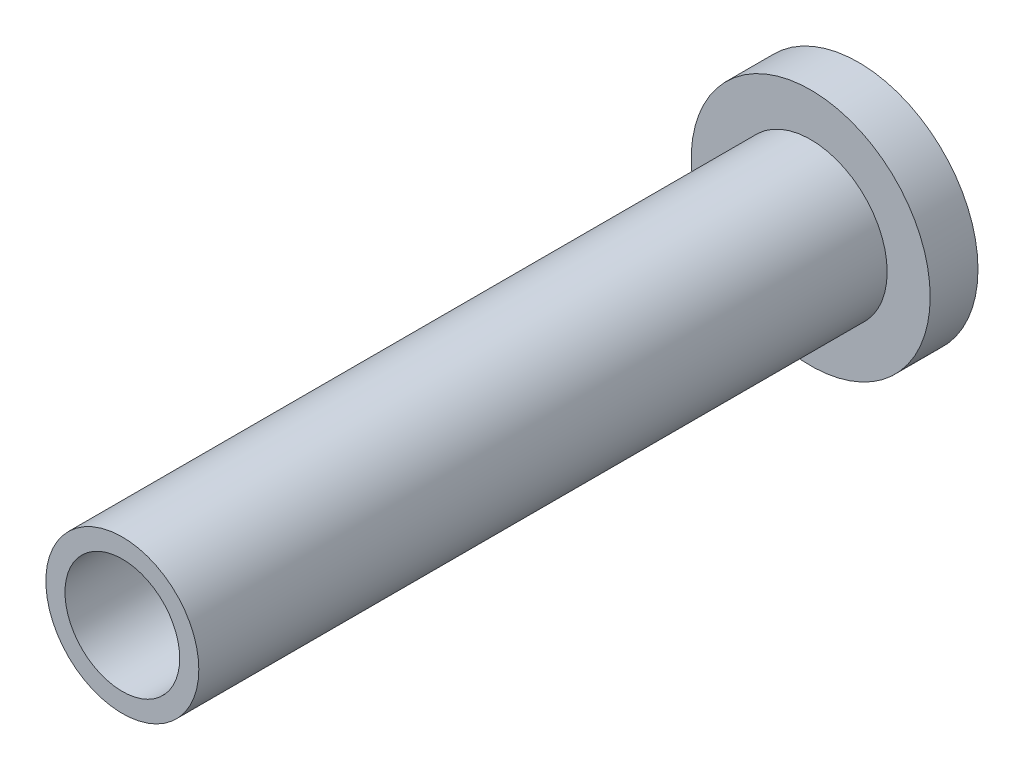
ISO-10303-21;
HEADER;
FILE_DESCRIPTION(('STEP AP214'),'2;1');
FILE_NAME('part.step','',(''),(''),'','','');
FILE_SCHEMA(('AUTOMOTIVE_DESIGN { 1 0 10303 214 1 1 1 1 }'));
ENDSEC;
DATA;
#1=APPLICATION_CONTEXT('core data for automotive mechanical design processes');
#2=APPLICATION_PROTOCOL_DEFINITION('international standard','automotive_design',2000,#1);
#3=PRODUCT_CONTEXT('',#1,'mechanical');
#4=PRODUCT('Part','Part','',(#3));
#5=PRODUCT_RELATED_PRODUCT_CATEGORY('part','',(#4));
#6=PRODUCT_DEFINITION_FORMATION('','',#4);
#7=PRODUCT_DEFINITION_CONTEXT('part definition',#1,'design');
#8=PRODUCT_DEFINITION('design','',#6,#7);
#9=PRODUCT_DEFINITION_SHAPE('','',#8);
#10=(LENGTH_UNIT() NAMED_UNIT(*) SI_UNIT(.MILLI.,.METRE.));
#11=(NAMED_UNIT(*) PLANE_ANGLE_UNIT() SI_UNIT($,.RADIAN.));
#12=(NAMED_UNIT(*) SI_UNIT($,.STERADIAN.) SOLID_ANGLE_UNIT());
#13=UNCERTAINTY_MEASURE_WITH_UNIT(LENGTH_MEASURE(1.E-05),#10,'distance_accuracy_value','');
#14=(GEOMETRIC_REPRESENTATION_CONTEXT(3) GLOBAL_UNCERTAINTY_ASSIGNED_CONTEXT((#13)) GLOBAL_UNIT_ASSIGNED_CONTEXT((#10,
#11,#12)) REPRESENTATION_CONTEXT('',''));
#15=CARTESIAN_POINT('',(0.,0.,0.));
#16=DIRECTION('',(0.,0.,1.));
#17=DIRECTION('',(1.,0.,0.));
#18=AXIS2_PLACEMENT_3D('',#15,#16,#17);
#19=CARTESIAN_POINT('',(0.,0.,15.));
#20=DIRECTION('',(0.,0.,1.));
#21=DIRECTION('',(1.,0.,0.));
#22=AXIS2_PLACEMENT_3D('',#19,#20,#21);
#23=CYLINDRICAL_SURFACE('',#22,5.25);
#24=CARTESIAN_POINT('',(0.,0.,15.));
#25=DIRECTION('',(0.,0.,1.));
#26=DIRECTION('',(1.,0.,0.));
#27=AXIS2_PLACEMENT_3D('',#24,#25,#26);
#28=CIRCLE('',#27,5.25);
#29=CARTESIAN_POINT('',(5.25,0.,15.));
#30=VERTEX_POINT('',#29);
#31=EDGE_CURVE('E53',#30,#30,#28,.T.);
#32=ORIENTED_EDGE('',*,*,#31,.F.);
#33=EDGE_LOOP('',(#32));
#34=FACE_BOUND('',#33,.T.);
#35=CARTESIAN_POINT('',(0.,0.,66.));
#36=DIRECTION('',(0.,0.,1.));
#37=DIRECTION('',(1.,0.,0.));
#38=AXIS2_PLACEMENT_3D('',#35,#36,#37);
#39=CIRCLE('',#38,5.25);
#40=CARTESIAN_POINT('',(5.25,0.,66.));
#41=VERTEX_POINT('',#40);
#42=EDGE_CURVE('E50',#41,#41,#39,.F.);
#43=ORIENTED_EDGE('',*,*,#42,.F.);
#44=EDGE_LOOP('',(#43));
#45=FACE_BOUND('',#44,.T.);
#46=ADVANCED_FACE('F32',(#34,#45),#23,.F.);
#47=CARTESIAN_POINT('',(0.,0.,0.));
#48=DIRECTION('',(0.,0.,1.));
#49=DIRECTION('',(1.,0.,0.));
#50=AXIS2_PLACEMENT_3D('',#47,#48,#49);
#51=CYLINDRICAL_SURFACE('',#50,3.);
#52=CARTESIAN_POINT('',(0.,0.,13.7298294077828));
#53=DIRECTION('',(0.,0.,1.));
#54=DIRECTION('',(1.,0.,0.));
#55=AXIS2_PLACEMENT_3D('',#52,#53,#54);
#56=CIRCLE('',#55,3.);
#57=CARTESIAN_POINT('',(3.,0.,13.7298294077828));
#58=VERTEX_POINT('',#57);
#59=EDGE_CURVE('E10',#58,#58,#56,.T.);
#60=ORIENTED_EDGE('',*,*,#59,.T.);
#61=EDGE_LOOP('',(#60));
#62=FACE_BOUND('',#61,.T.);
#63=CARTESIAN_POINT('',(0.,0.,0.));
#64=DIRECTION('',(0.,0.,1.));
#65=DIRECTION('',(1.,0.,0.));
#66=AXIS2_PLACEMENT_3D('',#63,#64,#65);
#67=CIRCLE('',#66,3.);
#68=CARTESIAN_POINT('',(3.,0.,0.));
#69=VERTEX_POINT('',#68);
#70=EDGE_CURVE('E62',#69,#69,#67,.T.);
#71=ORIENTED_EDGE('',*,*,#70,.F.);
#72=EDGE_LOOP('',(#71));
#73=FACE_BOUND('',#72,.T.);
#74=ADVANCED_FACE('F93',(#62,#73),#51,.F.);
#75=CARTESIAN_POINT('',(0.,0.,5.));
#76=DIRECTION('',(0.,0.,-1.));
#77=DIRECTION('',(-1.,0.,0.));
#78=AXIS2_PLACEMENT_3D('',#75,#76,#77);
#79=CYLINDRICAL_SURFACE('',#78,12.5);
#80=CARTESIAN_POINT('',(0.,0.,5.));
#81=DIRECTION('',(0.,0.,1.));
#82=DIRECTION('',(1.,0.,0.));
#83=AXIS2_PLACEMENT_3D('',#80,#81,#82);
#84=CIRCLE('',#83,12.5);
#85=CARTESIAN_POINT('',(12.5,0.,5.));
#86=VERTEX_POINT('',#85);
#87=EDGE_CURVE('E47',#86,#86,#84,.T.);
#88=ORIENTED_EDGE('',*,*,#87,.F.);
#89=EDGE_LOOP('',(#88));
#90=FACE_BOUND('',#89,.T.);
#91=CARTESIAN_POINT('',(0.,0.,0.));
#92=DIRECTION('',(0.,0.,1.));
#93=DIRECTION('',(1.,0.,0.));
#94=AXIS2_PLACEMENT_3D('',#91,#92,#93);
#95=CIRCLE('',#94,12.5);
#96=CARTESIAN_POINT('',(12.5,0.,0.));
#97=VERTEX_POINT('',#96);
#98=EDGE_CURVE('E57',#97,#97,#95,.T.);
#99=ORIENTED_EDGE('',*,*,#98,.T.);
#100=EDGE_LOOP('',(#99));
#101=FACE_BOUND('',#100,.T.);
#102=ADVANCED_FACE('F34',(#90,#101),#79,.T.);
#103=CARTESIAN_POINT('',(0.,0.,5.));
#104=DIRECTION('',(0.,0.,1.));
#105=DIRECTION('',(1.,0.,0.));
#106=AXIS2_PLACEMENT_3D('',#103,#104,#105);
#107=PLANE('',#106);
#108=CARTESIAN_POINT('',(0.,0.,5.));
#109=DIRECTION('',(0.,0.,1.));
#110=DIRECTION('',(1.,0.,0.));
#111=AXIS2_PLACEMENT_3D('',#108,#109,#110);
#112=CIRCLE('',#111,8.);
#113=CARTESIAN_POINT('',(8.,0.,5.));
#114=VERTEX_POINT('',#113);
#115=EDGE_CURVE('E43',#114,#114,#112,.T.);
#116=ORIENTED_EDGE('',*,*,#115,.F.);
#117=EDGE_LOOP('',(#116));
#118=FACE_BOUND('',#117,.T.);
#119=ORIENTED_EDGE('',*,*,#87,.T.);
#120=EDGE_LOOP('',(#119));
#121=FACE_BOUND('',#120,.T.);
#122=ADVANCED_FACE('F90',(#118,#121),#107,.T.);
#123=CARTESIAN_POINT('',(0.,0.,0.));
#124=DIRECTION('',(0.,0.,1.));
#125=DIRECTION('',(1.,0.,0.));
#126=AXIS2_PLACEMENT_3D('',#123,#124,#125);
#127=PLANE('',#126);
#128=ORIENTED_EDGE('',*,*,#70,.T.);
#129=EDGE_LOOP('',(#128));
#130=FACE_BOUND('',#129,.T.);
#131=ORIENTED_EDGE('',*,*,#98,.F.);
#132=EDGE_LOOP('',(#131));
#133=FACE_BOUND('',#132,.T.);
#134=ADVANCED_FACE('F82',(#130,#133),#127,.F.);
#135=CARTESIAN_POINT('',(0.,0.,77.));
#136=DIRECTION('',(0.,0.,-1.));
#137=DIRECTION('',(-1.,0.,0.));
#138=AXIS2_PLACEMENT_3D('',#135,#136,#137);
#139=CYLINDRICAL_SURFACE('',#138,8.);
#140=CARTESIAN_POINT('',(0.,0.,77.));
#141=DIRECTION('',(0.,0.,1.));
#142=DIRECTION('',(1.,0.,0.));
#143=AXIS2_PLACEMENT_3D('',#140,#141,#142);
#144=CIRCLE('',#143,8.);
#145=CARTESIAN_POINT('',(8.,0.,77.));
#146=VERTEX_POINT('',#145);
#147=EDGE_CURVE('E60',#146,#146,#144,.T.);
#148=ORIENTED_EDGE('',*,*,#147,.F.);
#149=EDGE_LOOP('',(#148));
#150=FACE_BOUND('',#149,.T.);
#151=ORIENTED_EDGE('',*,*,#115,.T.);
#152=EDGE_LOOP('',(#151));
#153=FACE_BOUND('',#152,.T.);
#154=ADVANCED_FACE('F80',(#150,#153),#139,.T.);
#155=CARTESIAN_POINT('',(0.,0.,77.));
#156=DIRECTION('',(0.,0.,1.));
#157=DIRECTION('',(1.,0.,0.));
#158=AXIS2_PLACEMENT_3D('',#155,#156,#157);
#159=PLANE('',#158);
#160=CARTESIAN_POINT('',(0.,0.,77.));
#161=DIRECTION('',(0.,0.,1.));
#162=DIRECTION('',(1.,0.,0.));
#163=AXIS2_PLACEMENT_3D('',#160,#161,#162);
#164=CIRCLE('',#163,6.);
#165=CARTESIAN_POINT('',(6.,0.,77.));
#166=VERTEX_POINT('',#165);
#167=EDGE_CURVE('E70',#166,#166,#164,.T.);
#168=ORIENTED_EDGE('',*,*,#167,.F.);
#169=EDGE_LOOP('',(#168));
#170=FACE_BOUND('',#169,.T.);
#171=ORIENTED_EDGE('',*,*,#147,.T.);
#172=EDGE_LOOP('',(#171));
#173=FACE_BOUND('',#172,.T.);
#174=ADVANCED_FACE('F76',(#170,#173),#159,.T.);
#175=CARTESIAN_POINT('',(0.,0.,15.));
#176=DIRECTION('',(0.,0.,1.));
#177=DIRECTION('',(1.,0.,0.));
#178=AXIS2_PLACEMENT_3D('',#175,#176,#177);
#179=PLANE('',#178);
#180=CARTESIAN_POINT('',(0.,0.,15.));
#181=DIRECTION('',(0.,0.,1.));
#182=DIRECTION('',(1.,0.,0.));
#183=AXIS2_PLACEMENT_3D('',#180,#181,#182);
#184=CIRCLE('',#183,5.20000000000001);
#185=CARTESIAN_POINT('',(5.20000000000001,0.,15.));
#186=VERTEX_POINT('',#185);
#187=EDGE_CURVE('E39',#186,#186,#184,.F.);
#188=ORIENTED_EDGE('',*,*,#187,.T.);
#189=EDGE_LOOP('',(#188));
#190=FACE_BOUND('',#189,.T.);
#191=ORIENTED_EDGE('',*,*,#31,.T.);
#192=EDGE_LOOP('',(#191));
#193=FACE_BOUND('',#192,.T.);
#194=ADVANCED_FACE('F79',(#190,#193),#179,.T.);
#195=CARTESIAN_POINT('',(0.,0.,66.));
#196=DIRECTION('',(0.,0.,1.));
#197=DIRECTION('',(1.,0.,0.));
#198=AXIS2_PLACEMENT_3D('',#195,#196,#197);
#199=PLANE('',#198);
#200=CARTESIAN_POINT('',(0.,0.,66.));
#201=DIRECTION('',(0.,0.,1.));
#202=DIRECTION('',(1.,0.,0.));
#203=AXIS2_PLACEMENT_3D('',#200,#201,#202);
#204=CIRCLE('',#203,6.);
#205=CARTESIAN_POINT('',(6.,0.,66.));
#206=VERTEX_POINT('',#205);
#207=EDGE_CURVE('E54',#206,#206,#204,.T.);
#208=ORIENTED_EDGE('',*,*,#207,.T.);
#209=EDGE_LOOP('',(#208));
#210=FACE_BOUND('',#209,.T.);
#211=ORIENTED_EDGE('',*,*,#42,.T.);
#212=EDGE_LOOP('',(#211));
#213=FACE_BOUND('',#212,.T.);
#214=ADVANCED_FACE('F117',(#210,#213),#199,.T.);
#215=CARTESIAN_POINT('',(0.,0.,66.));
#216=DIRECTION('',(0.,0.,1.));
#217=DIRECTION('',(1.,0.,0.));
#218=AXIS2_PLACEMENT_3D('',#215,#216,#217);
#219=CYLINDRICAL_SURFACE('',#218,6.);
#220=ORIENTED_EDGE('',*,*,#207,.F.);
#221=EDGE_LOOP('',(#220));
#222=FACE_BOUND('',#221,.T.);
#223=ORIENTED_EDGE('',*,*,#167,.T.);
#224=EDGE_LOOP('',(#223));
#225=FACE_BOUND('',#224,.T.);
#226=ADVANCED_FACE('F74',(#222,#225),#219,.F.);
#227=CARTESIAN_POINT('',(0.,0.,15.));
#228=DIRECTION('',(0.,0.,1.));
#229=DIRECTION('',(1.,0.,0.));
#230=AXIS2_PLACEMENT_3D('',#227,#228,#229);
#231=CONICAL_SURFACE('',#230,5.20000000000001,1.04719755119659);
#232=ORIENTED_EDGE('',*,*,#59,.F.);
#233=EDGE_LOOP('',(#232));
#234=FACE_BOUND('',#233,.T.);
#235=ORIENTED_EDGE('',*,*,#187,.F.);
#236=EDGE_LOOP('',(#235));
#237=FACE_BOUND('',#236,.T.);
#238=ADVANCED_FACE('F120',(#234,#237),#231,.F.);
#239=CLOSED_SHELL('',(#46,#74,#102,#122,#134,#154,#174,#194,#214,#226,#238));
#240=MANIFOLD_SOLID_BREP('B2',#239);
#241=ADVANCED_BREP_SHAPE_REPRESENTATION('',(#18,#240),#14);
#242=SHAPE_DEFINITION_REPRESENTATION(#9,#241);
ENDSEC;
END-ISO-10303-21;
